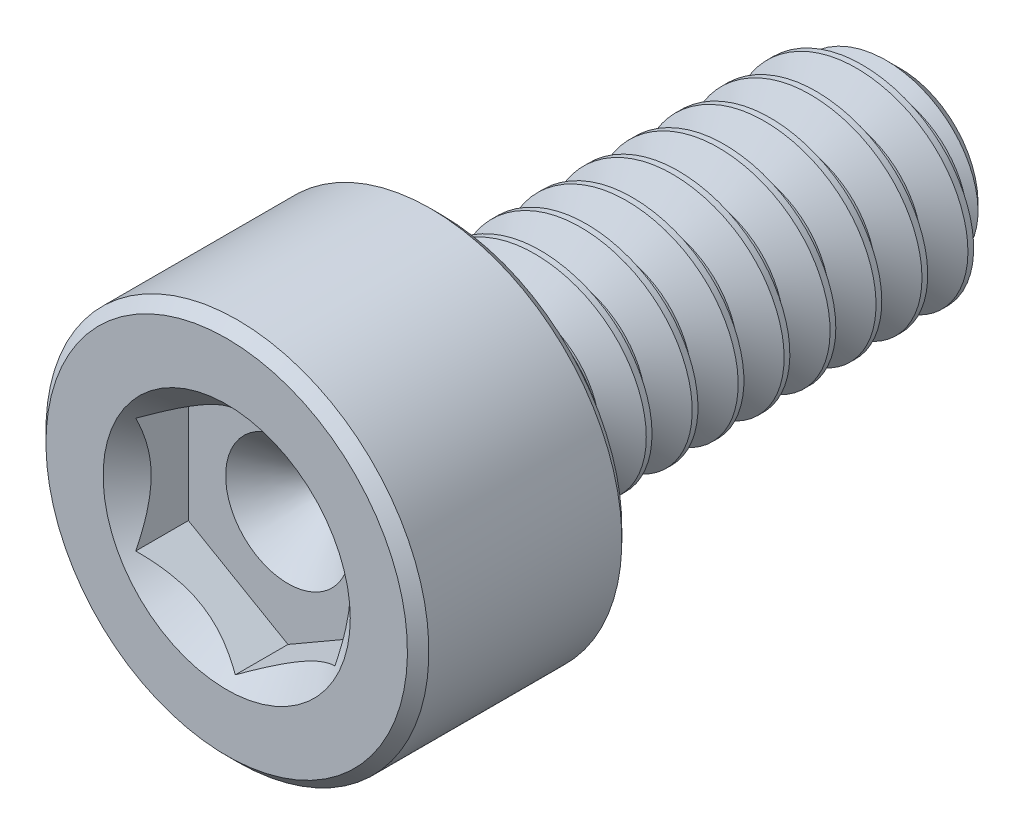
from build123d import *

# Parameters (mm, degrees)
CUT_EXTRUDE1_DEPTH     = 0.4
SKETCH4_R              = 0.806847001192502
CUT_EXTRUDE2_DEPTH     = 0.7
CUT_EXTRUDE2_DRAFT     = -45.0000000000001
SPLIT1_SURFACE_1_BACK  = 6.644
SPLIT1_SURFACE_1_DEPTH = 13.288
SPLIT1_SURFACE_2_BACK  = 6.644
SPLIT1_SURFACE_2_DEPTH = 13.288
CUT_SWEEP1_PITCH       = 0.3
CUT_SWEEP1_HEIGHT      = 3.3000000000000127
CUT_SWEEP1_RADIUS      = 0.7
CUT_SWEEP1_START_ANGLE = 89.99999999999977


with BuildPart() as part:
    # Sketch2 → Revolve1 (revolve)
    with BuildSketch(Plane(origin=(0, 0, 0), x_dir=(0, 0, -1), z_dir=(1, 0, 0))):
        with BuildLine():
            Line((-2.199999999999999, 0), (-2.199999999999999, 1.1800000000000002))
            Line((-2.199999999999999, 1.1800000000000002), (-2.129999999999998, 1.25))
            Line((-2.129999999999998, 1.25), (-0.8699999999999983, 1.25))
            Line((-0.8699999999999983, 1.25), (-0.7999999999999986, 1.1800000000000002))
            Line((-0.7999999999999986, 1.1800000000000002), (-0.7999999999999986, 0.7700000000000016))
            ThreePointArc((-0.7999999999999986, 0.7700000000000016), (-0.7794974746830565, 0.7205025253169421), (-0.7299999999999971, 0.7000000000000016))
            Line((-0.7299999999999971, 0.7000000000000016), (2.0051442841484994, 0.7))
            Line((2.0051442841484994, 0.7), (2.199999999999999, 0.5051442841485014))
            Line((2.199999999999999, 0.5051442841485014), (2.199999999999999, 0))
            Line((2.199999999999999, 0), (-2.199999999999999, 0))
        make_face()
    revolve(axis=Axis((0, 0, -2.199999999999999), (0, 0, 1)))

    # Sketch3 → Cut-Extrude1 (cut)
    with BuildSketch(Plane.XY.offset(2.199999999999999)):
        Polygon((0.65, -0.37527767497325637), (0.65, 0.3752776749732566), (-1.1e-16, 0.7505553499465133), (-0.6499999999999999, 0.3752776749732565), (-0.6499999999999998, -0.3752776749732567), (6e-17, -0.7505553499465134), align=None)
    extrude(amount=-CUT_EXTRUDE1_DEPTH, mode=Mode.SUBTRACT)


with BuildPart() as cut_extrude2_tool:
    # Sketch4 → Cut-Extrude2 (with draft: the straight prism first)
    with BuildSketch(Plane.XY.offset(2.199999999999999)):
        Circle(SKETCH4_R)
    extrude(amount=-CUT_EXTRUDE2_DEPTH)
    # Cut-Extrude2: the draft: its side faces are tilted about the plane it starts from
    cut_extrude2_sides = [cut_extrude2_tool.faces().sort_by_distance(p)[0] for p in [
        (-0.806847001, 0, 1.85),
    ]]
    draft(cut_extrude2_sides, Plane.XY.offset(2.199999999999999), CUT_EXTRUDE2_DRAFT)


with BuildPart() as part_1:
    add(part.part)

    # Cut-Extrude2: cut by cut_extrude2_tool
    add(cut_extrude2_tool.part, mode=Mode.SUBTRACT)


with BuildPart() as body_2:
    # Split1: the piece behind the surface
    add(part_1.part)
    # Split1 surface: a surface, the sketch's curves swept straight by 13.288 mm
    with BuildLine(Plane(origin=(0, 0, 0), x_dir=(0, 0, -1), z_dir=(1, 0, 0)).offset(-SPLIT1_SURFACE_1_BACK), mode=Mode.PRIVATE) as split1_surface_1_path:
        Line((-0.7299999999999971, -1.2500000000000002), (-0.7299999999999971, 1.2500000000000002))
    split1_surface_1 = Shell.extrude(split1_surface_1_path.wire(), (1 * SPLIT1_SURFACE_1_DEPTH, 0 * SPLIT1_SURFACE_1_DEPTH, 0 * SPLIT1_SURFACE_1_DEPTH))
    split(bisect_by=split1_surface_1, keep=Keep.BOTTOM)

    # Cut-Sweep1: sweep along a helix
    with BuildLine() as cut_sweep1_path:
        add(Helix(CUT_SWEEP1_PITCH, CUT_SWEEP1_HEIGHT, CUT_SWEEP1_RADIUS, center=(0, 0, -2.199999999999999), direction=(0, 0, 1), mode=Mode.PRIVATE).rotate(Axis((0, 0, -2.199999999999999), (0, 0, 1)), CUT_SWEEP1_START_ANGLE))
    # Sketch7 → Cut-Sweep1 (sweep, cut)
    with BuildSketch(Plane(origin=(0, 0, 0), x_dir=(0, 0, -1), z_dir=(1, 0, 0))):
        Polygon((2.1906249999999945, 0.7162379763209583), (2.4718749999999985, 0.7162379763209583), (2.349999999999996, 0.5051442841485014), (2.312499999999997, 0.5051442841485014), align=None)
    sweep(path=cut_sweep1_path.line, is_frenet=True, mode=Mode.SUBTRACT)


with BuildPart() as part_2:
    add(part_1.part)

    # Split1: split by a surface, the side it looks to stays
    # Split1 surface: a surface, the sketch's curves swept straight by 13.288 mm
    with BuildLine(Plane(origin=(0, 0, 0), x_dir=(0, 0, -1), z_dir=(1, 0, 0)).offset(-SPLIT1_SURFACE_2_BACK), mode=Mode.PRIVATE) as split1_surface_2_path:
        Line((-0.7299999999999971, -1.2500000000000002), (-0.7299999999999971, 1.2500000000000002))
    split1_surface_2 = Shell.extrude(split1_surface_2_path.wire(), (1 * SPLIT1_SURFACE_2_DEPTH, 0 * SPLIT1_SURFACE_2_DEPTH, 0 * SPLIT1_SURFACE_2_DEPTH))
    split(bisect_by=split1_surface_2, keep=Keep.TOP)

    add(body_2.part)  # Revolve2 merges body 2
    # Sketch8 → Revolve2 (revolve)
    with BuildSketch(Plane(origin=(0, 0, 0), x_dir=(0, 0, -1), z_dir=(1, 0, 0)), mode=Mode.PRIVATE) as revolve2_sk:
        Polygon((-0.7999999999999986, -1.6e-16), (-0.7999999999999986, 0.7), (-0.7299999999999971, 0.7000000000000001), (-0.32585481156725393, -1.2e-16), align=None)
    revolve(revolve2_sk.sketch.rotate(Axis((0, -1.2e-16, 0.32585481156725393), (0, -8e-17, 1)), 270), axis=Axis((0, -1.2e-16, 0.32585481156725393), (0, -8e-17, 1)))


solid = part_2.part
